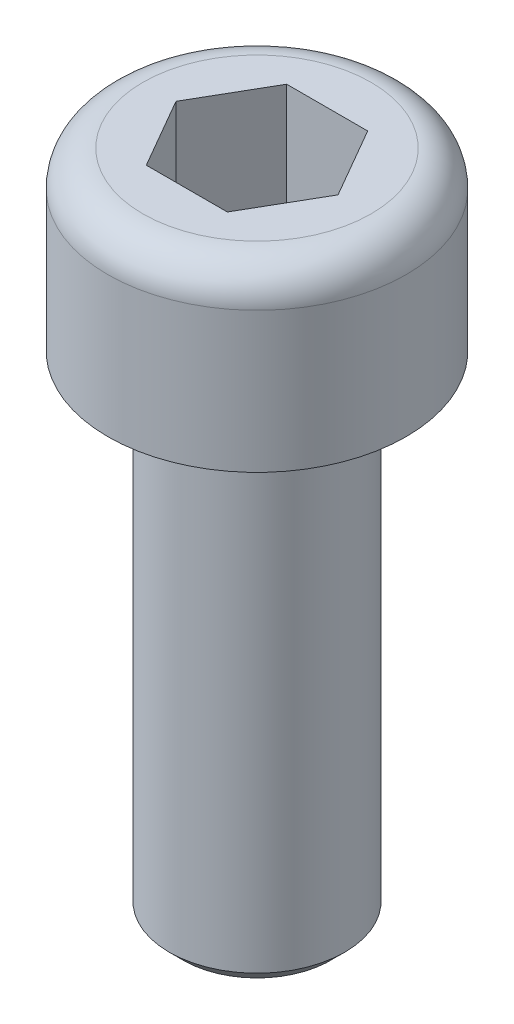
from build123d import *

# Parameters (mm, degrees)
ENL_V_MAT_EXTRU_1_DEPTH = 3.125


with BuildPart() as part:
    # Esquisse1 → R_volution1 (revolve)
    with BuildSketch(Plane.XY, mode=Mode.PRIVATE) as r_volution1_sk:
        with BuildLine():
            Line((0, 5), (3.25, 5))
            ThreePointArc((3.25, 5), (3.957106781, 4.707106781), (4.25, 4))
            Line((4.25, 4), (4.25, 0))
            Line((4.25, 0), (2.75, 0))
            ThreePointArc((2.75, 0), (2.573223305, -0.073223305), (2.5, -0.25))
            Line((2.5, -0.25), (2.5, -13.6))
            Line((2.5, -13.6), (2.1, -14))
            Line((2.1, -14), (0, -14))
            Line((0, -14), (0, 5))
        make_face()
    revolve(r_volution1_sk.sketch.rotate(Axis((0, 5, 0), (0, -1, 0)), 180), axis=Axis((0, 5, 0), (0, -1, 0)))

    # Esquisse2 → Enl_v. mat.-Extru.1 (cut)
    with BuildSketch(Plane(origin=(0, 5, 0), x_dir=(1, 0, 0), z_dir=(0, 1, 0))):
        Polygon((2.309401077, 0), (1.154700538, 2), (-1.154700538, 2), (-2.309401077, 0), (-1.154700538, -2), (1.154700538, -2), align=None)
    extrude(amount=-ENL_V_MAT_EXTRU_1_DEPTH, mode=Mode.SUBTRACT)


solid = part.part
